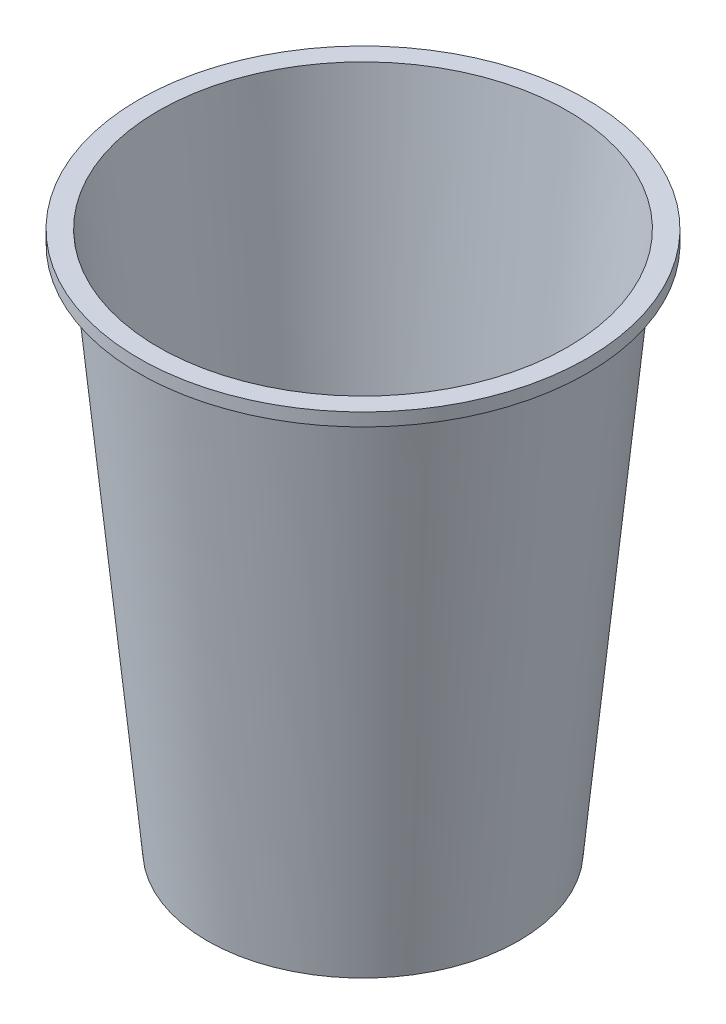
from build123d import *


with BuildPart() as part:
    # Sketch1 → Revolve1 (revolve)
    with BuildSketch(Plane.XY, mode=Mode.PRIVATE) as revolve1_sk:
        Polygon((31.75, -2), (24, -83), (0, -83), (0, -82.6), (23.636444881, -82.6), (31.539531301, 0), (34.539531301, 0), (34.539531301, -2), align=None)
    revolve(revolve1_sk.sketch.rotate(Axis((0, 0, 0), (0, -1, 0)), 180), axis=Axis((0, 0, 0), (0, -1, 0)))


solid = part.part
